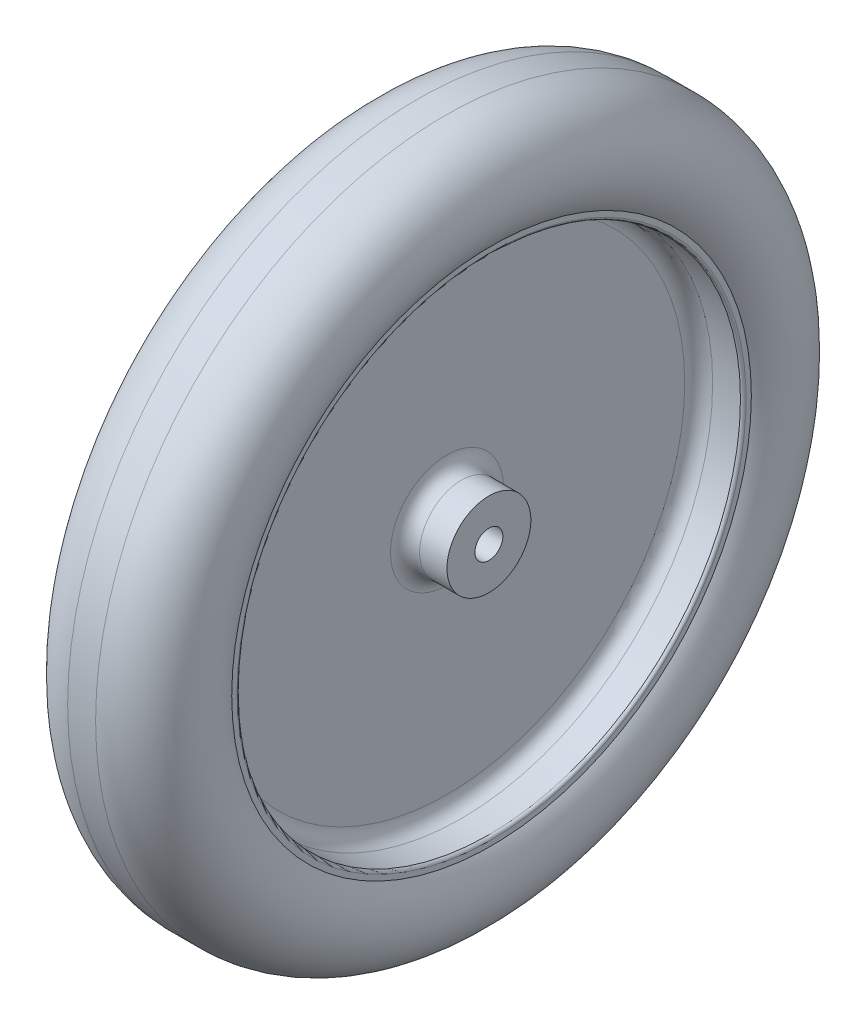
from build123d import *


with BuildPart() as part:
    # Esquisse2 → R_volution1 (revolve)
    with BuildSketch(Plane.XY, mode=Mode.PRIVATE) as r_volution1_sk:
        with BuildLine():
            Line((-9.954665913, 30), (-28.643760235, 30))
            Line((-28.643760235, 30), (-28.643760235, 10))
            Line((-28.643760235, 10), (51.356239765, 10))
            Line((51.356239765, 10), (51.356239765, 30))
            Line((51.356239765, 30), (31.756871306, 30))
            ThreePointArc((31.756871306, 30), (24.402514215, 33.04627445), (21.356239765, 40.400631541))
            Line((21.356239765, 40.400631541), (21.356239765, 170.079406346))
            ThreePointArc((21.356239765, 170.079406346), (24.285171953, 177.150474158), (31.356239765, 180.079406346))
            Line((31.356239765, 180.079406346), (51.239670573, 180.079406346))
            ThreePointArc((51.239670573, 180.079406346), (52.653884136, 180.665192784), (53.239670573, 182.079406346))
            Line((53.239670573, 182.079406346), (53.239670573, 185.868354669))
            ThreePointArc((53.239670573, 185.868354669), (56.869537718, 228.429673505), (20, 250))
            Line((20, 250), (0, 250))
            ThreePointArc((0, 250), (-34.646750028, 227.452420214), (-30.842517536, 186.290320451))
            Line((-30.842517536, 186.290320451), (-30.842517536, 182.079406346))
            ThreePointArc((-30.842517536, 182.079406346), (-30.256731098, 180.665192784), (-28.842517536, 180.079406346))
            Line((-28.842517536, 180.079406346), (-8.643760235, 180.079406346))
            ThreePointArc((-8.643760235, 180.079406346), (-1.572692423, 177.150474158), (1.356239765, 170.079406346))
            Line((1.356239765, 170.079406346), (1.356239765, 41.310905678))
            ThreePointArc((1.356239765, 41.310905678), (-1.956647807, 33.312887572), (-9.954665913, 30))
        make_face()
    revolve(r_volution1_sk.sketch.rotate(Axis((-36.268459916, 0, 0), (1, 0, 0)), 90), axis=Axis((-36.268459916, 0, 0), (1, 0, 0)))


solid = part.part
